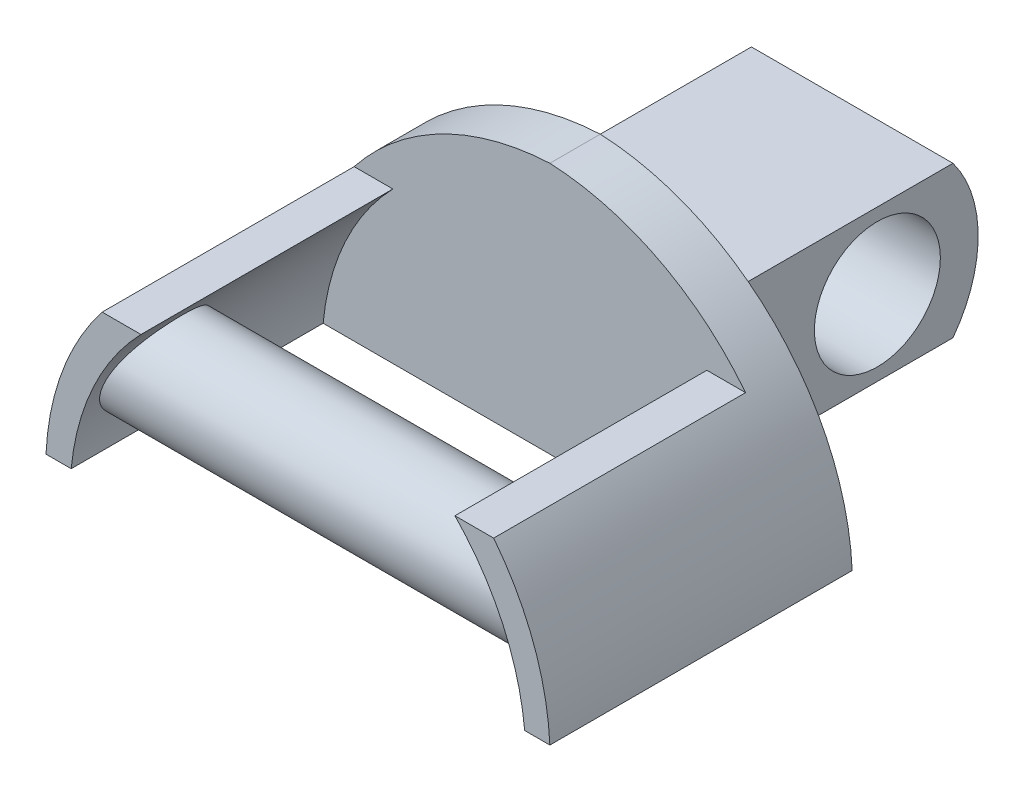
ISO-10303-21;
HEADER;
FILE_DESCRIPTION(('STEP AP214'),'2;1');
FILE_NAME('part.step','',(''),(''),'','','');
FILE_SCHEMA(('AUTOMOTIVE_DESIGN { 1 0 10303 214 1 1 1 1 }'));
ENDSEC;
DATA;
#1=APPLICATION_CONTEXT('core data for automotive mechanical design processes');
#2=APPLICATION_PROTOCOL_DEFINITION('international standard','automotive_design',2000,#1);
#3=PRODUCT_CONTEXT('',#1,'mechanical');
#4=PRODUCT('Part','Part','',(#3));
#5=PRODUCT_RELATED_PRODUCT_CATEGORY('part','',(#4));
#6=PRODUCT_DEFINITION_FORMATION('','',#4);
#7=PRODUCT_DEFINITION_CONTEXT('part definition',#1,'design');
#8=PRODUCT_DEFINITION('design','',#6,#7);
#9=PRODUCT_DEFINITION_SHAPE('','',#8);
#10=(LENGTH_UNIT() NAMED_UNIT(*) SI_UNIT(.MILLI.,.METRE.));
#11=(NAMED_UNIT(*) PLANE_ANGLE_UNIT() SI_UNIT($,.RADIAN.));
#12=(NAMED_UNIT(*) SI_UNIT($,.STERADIAN.) SOLID_ANGLE_UNIT());
#13=UNCERTAINTY_MEASURE_WITH_UNIT(LENGTH_MEASURE(1.E-05),#10,'distance_accuracy_value','');
#14=(GEOMETRIC_REPRESENTATION_CONTEXT(3) GLOBAL_UNCERTAINTY_ASSIGNED_CONTEXT((#13)) GLOBAL_UNIT_ASSIGNED_CONTEXT((#10,
#11,#12)) REPRESENTATION_CONTEXT('',''));
#15=CARTESIAN_POINT('',(0.,0.,0.));
#16=DIRECTION('',(0.,0.,1.));
#17=DIRECTION('',(1.,0.,0.));
#18=AXIS2_PLACEMENT_3D('',#15,#16,#17);
#19=CARTESIAN_POINT('',(0.482716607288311,-0.482716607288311,12.));
#20=DIRECTION('',(0.,0.,1.));
#21=DIRECTION('',(1.,0.,0.));
#22=AXIS2_PLACEMENT_3D('',#19,#20,#21);
#23=PLANE('',#22);
#24=DIRECTION('',(1.,0.,0.));
#25=VECTOR('',#24,1.);
#26=CARTESIAN_POINT('',(-8.,6.,12.));
#27=LINE('',#26,#25);
#28=CARTESIAN_POINT('',(-7.76923759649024,6.,12.));
#29=VERTEX_POINT('',#28);
#30=CARTESIAN_POINT('',(-6.23152814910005,6.,12.));
#31=VERTEX_POINT('',#30);
#32=EDGE_CURVE('E293',#29,#31,#27,.T.);
#33=ORIENTED_EDGE('',*,*,#32,.F.);
#34=CARTESIAN_POINT('',(0.482716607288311,-0.482716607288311,12.));
#35=DIRECTION('',(0.,0.,1.));
#36=DIRECTION('',(1.,0.,0.));
#37=AXIS2_PLACEMENT_3D('',#34,#35,#36);
#38=CIRCLE('',#37,10.4938249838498);
#39=CARTESIAN_POINT('',(-10.,0.,12.));
#40=VERTEX_POINT('',#39);
#41=EDGE_CURVE('E263',#29,#40,#38,.T.);
#42=ORIENTED_EDGE('',*,*,#41,.T.);
#43=DIRECTION('',(1.,0.,0.));
#44=VECTOR('',#43,1.);
#45=CARTESIAN_POINT('',(10.,0.,12.));
#46=LINE('',#45,#44);
#47=CARTESIAN_POINT('',(-9.,0.,12.));
#48=VERTEX_POINT('',#47);
#49=EDGE_CURVE('E177',#40,#48,#46,.T.);
#50=ORIENTED_EDGE('',*,*,#49,.T.);
#51=CARTESIAN_POINT('',(0.954356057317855,-0.954356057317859,12.));
#52=DIRECTION('',(0.,0.,1.));
#53=DIRECTION('',(1.,0.,0.));
#54=AXIS2_PLACEMENT_3D('',#51,#52,#53);
#55=CIRCLE('',#54,10.);
#56=EDGE_CURVE('E292',#31,#48,#55,.T.);
#57=ORIENTED_EDGE('',*,*,#56,.F.);
#58=EDGE_LOOP('',(#33,#42,#50,#57));
#59=FACE_BOUND('',#58,.T.);
#60=ADVANCED_FACE('F44',(#59),#23,.T.);
#61=CARTESIAN_POINT('',(-0.954356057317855,-0.954356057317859,2.));
#62=DIRECTION('',(0.,0.,1.));
#63=DIRECTION('',(1.,0.,0.));
#64=AXIS2_PLACEMENT_3D('',#61,#62,#63);
#65=CYLINDRICAL_SURFACE('',#64,10.);
#66=CARTESIAN_POINT('',(-0.954356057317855,-0.954356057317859,12.));
#67=DIRECTION('',(0.,0.,1.));
#68=DIRECTION('',(-1.,0.,0.));
#69=AXIS2_PLACEMENT_3D('',#66,#67,#68);
#70=CIRCLE('',#69,10.);
#71=CARTESIAN_POINT('',(9.,0.,12.));
#72=VERTEX_POINT('',#71);
#73=CARTESIAN_POINT('',(6.23152814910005,6.,12.));
#74=VERTEX_POINT('',#73);
#75=EDGE_CURVE('E350',#72,#74,#70,.T.);
#76=ORIENTED_EDGE('',*,*,#75,.T.);
#77=DIRECTION('',(0.,0.,1.));
#78=VECTOR('',#77,1.);
#79=CARTESIAN_POINT('',(6.23152814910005,6.,2.));
#80=LINE('',#79,#78);
#81=CARTESIAN_POINT('',(6.23152814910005,6.,2.));
#82=VERTEX_POINT('',#81);
#83=EDGE_CURVE('E60',#74,#82,#80,.F.);
#84=ORIENTED_EDGE('',*,*,#83,.T.);
#85=CARTESIAN_POINT('',(-0.954356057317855,-0.954356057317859,2.));
#86=DIRECTION('',(0.,0.,1.));
#87=DIRECTION('',(-1.,0.,0.));
#88=AXIS2_PLACEMENT_3D('',#85,#86,#87);
#89=CIRCLE('',#88,10.);
#90=CARTESIAN_POINT('',(9.,0.,2.));
#91=VERTEX_POINT('',#90);
#92=EDGE_CURVE('E155',#91,#82,#89,.T.);
#93=ORIENTED_EDGE('',*,*,#92,.F.);
#94=DIRECTION('',(0.,0.,1.));
#95=VECTOR('',#94,1.);
#96=CARTESIAN_POINT('',(9.,0.,2.));
#97=LINE('',#96,#95);
#98=EDGE_CURVE('E260',#91,#72,#97,.T.);
#99=ORIENTED_EDGE('',*,*,#98,.T.);
#100=EDGE_LOOP('',(#76,#84,#93,#99));
#101=FACE_BOUND('',#100,.T.);
#102=CARTESIAN_POINT('',(8.23058096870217,3.,11.5));
#103=CARTESIAN_POINT('',(8.17672790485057,3.12507858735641,11.4999969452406));
#104=CARTESIAN_POINT('',(8.12028081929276,3.2490897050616,11.4882441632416));
#105=CARTESIAN_POINT('',(8.00406708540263,3.49140314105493,11.4426171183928));
#106=CARTESIAN_POINT('',(7.94429714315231,3.60969956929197,11.4087205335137));
#107=CARTESIAN_POINT('',(7.82377305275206,3.83740828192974,11.3203381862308));
#108=CARTESIAN_POINT('',(7.76302136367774,3.94683956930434,11.2658979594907));
#109=CARTESIAN_POINT('',(7.64288957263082,4.1546345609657,11.1376011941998));
#110=CARTESIAN_POINT('',(7.58351022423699,4.25299229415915,11.0637342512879));
#111=CARTESIAN_POINT('',(7.46792747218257,4.43798068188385,10.8957712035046));
#112=CARTESIAN_POINT('',(7.41182482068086,4.52429980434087,10.8012595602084));
#113=CARTESIAN_POINT('',(7.30847942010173,4.67895528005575,10.5943942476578));
#114=CARTESIAN_POINT('',(7.26121795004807,4.74732975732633,10.4820792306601));
#115=CARTESIAN_POINT('',(7.19244726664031,4.84495887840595,10.2777496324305));
#116=CARTESIAN_POINT('',(7.16745593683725,4.87980248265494,10.1895602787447));
#117=CARTESIAN_POINT('',(7.12610447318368,4.93694339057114,10.0072901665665));
#118=CARTESIAN_POINT('',(7.10973566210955,4.95925330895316,9.91321543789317));
#119=CARTESIAN_POINT('',(7.08700900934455,4.99012303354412,9.72115564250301));
#120=CARTESIAN_POINT('',(7.08069860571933,4.99861768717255,9.62315426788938));
#121=CARTESIAN_POINT('',(7.07888178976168,5.00106957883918,9.42686347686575));
#122=CARTESIAN_POINT('',(7.08337467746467,4.9950277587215,9.32857407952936));
#123=CARTESIAN_POINT('',(7.1019768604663,4.96980716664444,9.14214941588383));
#124=CARTESIAN_POINT('',(7.11535228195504,4.95163041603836,9.05379998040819));
#125=CARTESIAN_POINT('',(7.14989282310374,4.90414249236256,8.8817681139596));
#126=CARTESIAN_POINT('',(7.17105979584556,4.8748286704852,8.79808679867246));
#127=CARTESIAN_POINT('',(7.22142822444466,4.80399048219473,8.63145937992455));
#128=CARTESIAN_POINT('',(7.25107597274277,4.76177481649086,8.54894512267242));
#129=CARTESIAN_POINT('',(7.31588481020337,4.66759944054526,8.39207643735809));
#130=CARTESIAN_POINT('',(7.35104860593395,4.61563494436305,8.31772604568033));
#131=CARTESIAN_POINT('',(7.43167109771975,4.49364881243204,8.16580977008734));
#132=CARTESIAN_POINT('',(7.47786014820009,4.42205865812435,8.08989142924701));
#133=CARTESIAN_POINT('',(7.57339935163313,4.26919917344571,7.95086351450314));
#134=CARTESIAN_POINT('',(7.62275167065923,4.18792317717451,7.88776284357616));
#135=CARTESIAN_POINT('',(7.73088670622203,4.00343909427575,7.76586558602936));
#136=CARTESIAN_POINT('',(7.78990396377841,3.89880966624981,7.70941464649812));
#137=CARTESIAN_POINT('',(7.90733899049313,3.68091044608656,7.61574054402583));
#138=CARTESIAN_POINT('',(7.96575647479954,3.56763674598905,7.57852613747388));
#139=CARTESIAN_POINT('',(8.08304737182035,3.32863079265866,7.52317355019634));
#140=CARTESIAN_POINT('',(8.14177320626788,3.20255602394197,7.50618129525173));
#141=CARTESIAN_POINT('',(8.25417311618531,2.94723541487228,7.49662437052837));
#142=CARTESIAN_POINT('',(8.30784903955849,2.81799075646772,7.50405072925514));
#143=CARTESIAN_POINT('',(8.40551905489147,2.56837711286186,7.54329017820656));
#144=CARTESIAN_POINT('',(8.44989613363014,2.44793174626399,7.57364905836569));
#145=CARTESIAN_POINT('',(8.5316850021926,2.21274126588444,7.657239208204));
#146=CARTESIAN_POINT('',(8.56910116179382,2.09799260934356,7.71045605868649));
#147=CARTESIAN_POINT('',(8.63348064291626,1.88893286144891,7.83300534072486));
#148=CARTESIAN_POINT('',(8.66108190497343,1.79371186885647,7.90045454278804));
#149=CARTESIAN_POINT('',(8.71020681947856,1.61561773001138,8.05185339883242));
#150=CARTESIAN_POINT('',(8.73173247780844,1.53274051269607,8.13579759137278));
#151=CARTESIAN_POINT('',(8.76801581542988,1.38676447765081,8.31261610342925));
#152=CARTESIAN_POINT('',(8.7830842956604,1.32281966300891,8.40473003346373));
#153=CARTESIAN_POINT('',(8.80855539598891,1.21102148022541,8.59883745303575));
#154=CARTESIAN_POINT('',(8.8189585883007,1.16316613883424,8.70082972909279));
#155=CARTESIAN_POINT('',(8.83537739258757,1.08590353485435,8.90973662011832));
#156=CARTESIAN_POINT('',(8.84147078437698,1.05617065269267,9.01652489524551));
#157=CARTESIAN_POINT('',(8.84988545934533,1.01473032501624,9.23368788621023));
#158=CARTESIAN_POINT('',(8.85220682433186,1.00302248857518,9.34406252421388));
#159=CARTESIAN_POINT('',(8.85320537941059,0.998013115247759,9.56492178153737));
#160=CARTESIAN_POINT('',(8.85189315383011,1.00465811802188,9.675405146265));
#161=CARTESIAN_POINT('',(8.84557350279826,1.03602896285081,9.89366533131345));
#162=CARTESIAN_POINT('',(8.84056612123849,1.06075459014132,10.0014421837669));
#163=CARTESIAN_POINT('',(8.8265973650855,1.12749490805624,10.2112235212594));
#164=CARTESIAN_POINT('',(8.81763627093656,1.16950837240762,10.3132284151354));
#165=CARTESIAN_POINT('',(8.79537562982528,1.26945607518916,10.5085909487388));
#166=CARTESIAN_POINT('',(8.78207626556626,1.32738964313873,10.6019489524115));
#167=CARTESIAN_POINT('',(8.75069829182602,1.45736134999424,10.7775833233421));
#168=CARTESIAN_POINT('',(8.73261226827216,1.52942132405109,10.859842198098));
#169=CARTESIAN_POINT('',(8.69133459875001,1.68517571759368,11.0109643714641));
#170=CARTESIAN_POINT('',(8.66814266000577,1.76887080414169,11.0798269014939));
#171=CARTESIAN_POINT('',(8.61618472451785,1.94622680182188,11.2033457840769));
#172=CARTESIAN_POINT('',(8.58735285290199,2.03999892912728,11.2578143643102));
#173=CARTESIAN_POINT('',(8.52442840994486,2.23358882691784,11.3504401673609));
#174=CARTESIAN_POINT('',(8.49033668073,2.33340562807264,11.3885999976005));
#175=CARTESIAN_POINT('',(8.42034196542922,2.5277131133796,11.4458523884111));
#176=CARTESIAN_POINT('',(8.38482371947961,2.62195890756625,11.4662638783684));
#177=CARTESIAN_POINT('',(8.31022173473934,2.81100483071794,11.4933408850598));
#178=CARTESIAN_POINT('',(8.27113693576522,2.90580511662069,11.5000023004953));
#179=CARTESIAN_POINT('',(8.23058096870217,3.,11.5));
#180=B_SPLINE_CURVE_WITH_KNOTS('',3,(#102,#103,#104,#105,#106,#107,#108,#109,#110,#111,#112,
#113,#114,#115,#116,#117,#118,#119,#120,#121,#122,#123,#124,#125,#126,#127,#128,#129,#130,#131,
#132,#133,#134,#135,#136,#137,#138,#139,#140,#141,#142,#143,#144,#145,#146,#147,#148,#149,#150,
#151,#152,#153,#154,#155,#156,#157,#158,#159,#160,#161,#162,#163,#164,#165,#166,#167,#168,#169,
#170,#171,#172,#173,#174,#175,#176,#177,#178,#179),.UNSPECIFIED.,.T.,.F.,(4,2,2,2,2,2,2,2,2,2,2,
2,2,2,2,2,2,2,2,2,2,2,2,2,2,2,2,2,2,2,2,2,2,2,2,2,2,2,4),(0.,0.408145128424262,
0.816702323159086,1.22435920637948,1.6322348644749,2.04923413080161,2.4653401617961,
2.75833680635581,3.05103802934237,3.34511566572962,3.63917424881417,3.91153952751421,
4.18396962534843,4.47481017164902,4.76579387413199,5.10684011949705,5.44812244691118,
5.84458723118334,6.24123232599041,6.65942143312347,7.07745691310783,7.47100137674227,
7.86429794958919,8.22217073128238,8.57992522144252,8.91770300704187,9.25543935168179,
9.5869132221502,9.91837990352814,10.2488820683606,10.5793803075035,10.9098551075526,
11.2403159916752,11.5712917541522,11.902286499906,12.2374069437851,12.5724737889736,
12.87975036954,13.1871185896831),.UNSPECIFIED.);
#181=CARTESIAN_POINT('',(8.23058096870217,3.,11.5));
#182=VERTEX_POINT('',#181);
#183=EDGE_CURVE('E53',#182,#182,#180,.T.);
#184=ORIENTED_EDGE('',*,*,#183,.F.);
#185=EDGE_LOOP('',(#184));
#186=FACE_BOUND('',#185,.T.);
#187=ADVANCED_FACE('F235',(#101,#186),#65,.F.);
#188=CARTESIAN_POINT('',(0.954356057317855,-0.954356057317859,2.));
#189=DIRECTION('',(0.,0.,1.));
#190=DIRECTION('',(1.,0.,0.));
#191=AXIS2_PLACEMENT_3D('',#188,#189,#190);
#192=CYLINDRICAL_SURFACE('',#191,10.);
#193=CARTESIAN_POINT('',(0.954356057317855,-0.954356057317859,2.));
#194=DIRECTION('',(0.,0.,1.));
#195=DIRECTION('',(1.,0.,0.));
#196=AXIS2_PLACEMENT_3D('',#193,#194,#195);
#197=CIRCLE('',#196,10.);
#198=CARTESIAN_POINT('',(-6.23152814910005,6.,2.));
#199=VERTEX_POINT('',#198);
#200=CARTESIAN_POINT('',(-9.,0.,2.));
#201=VERTEX_POINT('',#200);
#202=EDGE_CURVE('E358',#199,#201,#197,.T.);
#203=ORIENTED_EDGE('',*,*,#202,.F.);
#204=DIRECTION('',(0.,0.,1.));
#205=VECTOR('',#204,1.);
#206=CARTESIAN_POINT('',(-6.23152814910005,6.,2.));
#207=LINE('',#206,#205);
#208=EDGE_CURVE('E304',#199,#31,#207,.T.);
#209=ORIENTED_EDGE('',*,*,#208,.T.);
#210=ORIENTED_EDGE('',*,*,#56,.T.);
#211=DIRECTION('',(0.,0.,1.));
#212=VECTOR('',#211,1.);
#213=CARTESIAN_POINT('',(-9.,0.,2.));
#214=LINE('',#213,#212);
#215=EDGE_CURVE('E290',#201,#48,#214,.T.);
#216=ORIENTED_EDGE('',*,*,#215,.F.);
#217=EDGE_LOOP('',(#203,#209,#210,#216));
#218=FACE_BOUND('',#217,.T.);
#219=CARTESIAN_POINT('',(-8.23058096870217,3.,11.5));
#220=CARTESIAN_POINT('',(-8.2788257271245,2.88794750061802,11.5000020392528));
#221=CARTESIAN_POINT('',(-8.32499049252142,2.77502252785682,11.490572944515));
#222=CARTESIAN_POINT('',(-8.4120955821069,2.55050408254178,11.4521527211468));
#223=CARTESIAN_POINT('',(-8.45303948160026,2.43890974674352,11.4231750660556));
#224=CARTESIAN_POINT('',(-8.52907360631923,2.22023345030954,11.345392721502));
#225=CARTESIAN_POINT('',(-8.56414364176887,2.11316796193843,11.2965215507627));
#226=CARTESIAN_POINT('',(-8.62787172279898,1.90789308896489,11.1796546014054));
#227=CARTESIAN_POINT('',(-8.65653041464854,1.80968281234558,11.1116607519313));
#228=CARTESIAN_POINT('',(-8.70603450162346,1.63117577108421,10.9625609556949));
#229=CARTESIAN_POINT('',(-8.72722720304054,1.55018438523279,10.8824008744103));
#230=CARTESIAN_POINT('',(-8.76422830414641,1.4025329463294,10.7087510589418));
#231=CARTESIAN_POINT('',(-8.7800378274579,1.3358699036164,10.6152641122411));
#232=CARTESIAN_POINT('',(-8.80625907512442,1.22135872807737,10.4212380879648));
#233=CARTESIAN_POINT('',(-8.81684158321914,1.17292968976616,10.3210642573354));
#234=CARTESIAN_POINT('',(-8.8338457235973,1.09327068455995,10.1137668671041));
#235=CARTESIAN_POINT('',(-8.84026762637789,1.06203959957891,10.0066437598));
#236=CARTESIAN_POINT('',(-8.84923222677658,1.01799340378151,9.78950928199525));
#237=CARTESIAN_POINT('',(-8.85180861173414,1.00501842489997,9.67953168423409));
#238=CARTESIAN_POINT('',(-8.85333222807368,0.997378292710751,9.45891685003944));
#239=CARTESIAN_POINT('',(-8.8522794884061,1.00271299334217,9.34827961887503));
#240=CARTESIAN_POINT('',(-8.84648771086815,1.03151224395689,9.12958003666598));
#241=CARTESIAN_POINT('',(-8.84175162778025,1.05496226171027,9.02151569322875));
#242=CARTESIAN_POINT('',(-8.82834947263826,1.1192257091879,8.81093888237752));
#243=CARTESIAN_POINT('',(-8.81968348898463,1.1600387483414,8.70842629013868));
#244=CARTESIAN_POINT('',(-8.79803992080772,1.25771602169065,8.51182116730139));
#245=CARTESIAN_POINT('',(-8.78506125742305,1.3145842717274,8.41773075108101));
#246=CARTESIAN_POINT('',(-8.75437589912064,1.44248221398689,8.24060697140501));
#247=CARTESIAN_POINT('',(-8.73666935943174,1.51351144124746,8.1575732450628));
#248=CARTESIAN_POINT('',(-8.69608667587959,1.66772828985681,8.00436565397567));
#249=CARTESIAN_POINT('',(-8.67318623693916,1.75097238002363,7.934255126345));
#250=CARTESIAN_POINT('',(-8.62210031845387,1.92658752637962,7.80901768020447));
#251=CARTESIAN_POINT('',(-8.59391454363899,2.01895909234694,7.7538915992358));
#252=CARTESIAN_POINT('',(-8.53163948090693,2.21209404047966,7.65851407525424));
#253=CARTESIAN_POINT('',(-8.49742895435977,2.31300190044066,7.61863530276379));
#254=CARTESIAN_POINT('',(-8.42397937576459,2.51820913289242,7.55593238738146));
#255=CARTESIAN_POINT('',(-8.38473914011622,2.62250929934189,7.53311226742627));
#256=CARTESIAN_POINT('',(-8.29955142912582,2.83765170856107,7.50347883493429));
#257=CARTESIAN_POINT('',(-8.25334911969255,2.94852794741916,7.49765216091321));
#258=CARTESIAN_POINT('',(-8.15716969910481,3.16808099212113,7.50404790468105));
#259=CARTESIAN_POINT('',(-8.10719135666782,3.27675706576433,7.51627623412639));
#260=CARTESIAN_POINT('',(-8.00035832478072,3.4986779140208,7.55959499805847));
#261=CARTESIAN_POINT('',(-7.94328111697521,3.61151840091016,7.59220930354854));
#262=CARTESIAN_POINT('',(-7.82805440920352,3.82941736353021,7.67634270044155));
#263=CARTESIAN_POINT('',(-7.76990408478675,3.93446951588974,7.72787695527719));
#264=CARTESIAN_POINT('',(-7.65082378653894,4.1413348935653,7.85289794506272));
#265=CARTESIAN_POINT('',(-7.58997461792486,4.24243892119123,7.92764186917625));
#266=CARTESIAN_POINT('',(-7.4728671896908,4.43026462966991,8.09634472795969));
#267=CARTESIAN_POINT('',(-7.41660481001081,4.51699929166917,8.19028614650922));
#268=CARTESIAN_POINT('',(-7.3240971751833,4.65568787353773,8.37355954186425));
#269=CARTESIAN_POINT('',(-7.28616302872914,4.71110132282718,8.45942364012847));
#270=CARTESIAN_POINT('',(-7.21794078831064,4.80907422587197,8.64100689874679));
#271=CARTESIAN_POINT('',(-7.1876471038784,4.85164308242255,8.73671878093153));
#272=CARTESIAN_POINT('',(-7.13697926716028,4.92205560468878,8.93693330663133));
#273=CARTESIAN_POINT('',(-7.11668945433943,4.94977423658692,9.04150226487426));
#274=CARTESIAN_POINT('',(-7.08863483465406,4.9879405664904,9.25536033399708));
#275=CARTESIAN_POINT('',(-7.08085678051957,4.99840653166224,9.36464432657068));
#276=CARTESIAN_POINT('',(-7.07888777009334,5.00105952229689,9.56831445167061));
#277=CARTESIAN_POINT('',(-7.08296136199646,4.99558123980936,9.66266379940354));
#278=CARTESIAN_POINT('',(-7.10066603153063,4.97159015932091,9.84875685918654));
#279=CARTESIAN_POINT('',(-7.11429762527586,4.95307665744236,9.94050043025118));
#280=CARTESIAN_POINT('',(-7.14955604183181,4.90460902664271,10.1169799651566));
#281=CARTESIAN_POINT('',(-7.17099989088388,4.87491623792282,10.2018258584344));
#282=CARTESIAN_POINT('',(-7.2204439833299,4.805371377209,10.3651722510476));
#283=CARTESIAN_POINT('',(-7.24844637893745,4.76551596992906,10.4436706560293));
#284=CARTESIAN_POINT('',(-7.31356064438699,4.67105549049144,10.6033053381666));
#285=CARTESIAN_POINT('',(-7.35138889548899,4.61519332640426,10.6834021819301));
#286=CARTESIAN_POINT('',(-7.43151153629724,4.49381077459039,10.8333603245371));
#287=CARTESIAN_POINT('',(-7.47380835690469,4.42828512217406,10.9032160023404));
#288=CARTESIAN_POINT('',(-7.56908245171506,4.27636096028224,11.043847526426));
#289=CARTESIAN_POINT('',(-7.6226064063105,4.18833163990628,11.1124971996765));
#290=CARTESIAN_POINT('',(-7.73119191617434,4.00274502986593,11.2340208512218));
#291=CARTESIAN_POINT('',(-7.78625515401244,3.90517699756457,11.2868767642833));
#292=CARTESIAN_POINT('',(-7.9087507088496,3.67872962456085,11.3862555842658));
#293=CARTESIAN_POINT('',(-7.97607499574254,3.54785236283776,11.428431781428));
#294=CARTESIAN_POINT('',(-8.10687233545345,3.27843354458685,11.4852942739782));
#295=CARTESIAN_POINT('',(-8.17034773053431,3.13989674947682,11.4999974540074));
#296=CARTESIAN_POINT('',(-8.23058096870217,3.,11.5));
#297=B_SPLINE_CURVE_WITH_KNOTS('',3,(#219,#220,#221,#222,#223,#224,#225,#226,#227,#228,#229,
#230,#231,#232,#233,#234,#235,#236,#237,#238,#239,#240,#241,#242,#243,#244,#245,#246,#247,#248,
#249,#250,#251,#252,#253,#254,#255,#256,#257,#258,#259,#260,#261,#262,#263,#264,#265,#266,#267,
#268,#269,#270,#271,#272,#273,#274,#275,#276,#277,#278,#279,#280,#281,#282,#283,#284,#285,#286,
#287,#288,#289,#290,#291,#292,#293,#294,#295,#296),.UNSPECIFIED.,.T.,.F.,(4,2,2,2,2,2,2,2,2,2,2,
2,2,2,2,2,2,2,2,2,2,2,2,2,2,2,2,2,2,2,2,2,2,2,2,2,2,2,4),(0.,0.365530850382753,
0.730810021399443,1.09732005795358,1.4637931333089,1.80977273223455,2.15568007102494,
2.48938160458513,2.8230614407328,3.15380067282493,3.48453726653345,3.81500881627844,
4.14547293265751,4.4760197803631,4.80655577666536,5.13867100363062,5.47080479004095,
5.81060420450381,6.15048372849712,6.5097383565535,6.86911063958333,7.25922110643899,
7.64964491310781,8.06668851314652,8.48335328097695,8.80909044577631,9.13458857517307,
9.46278585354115,9.79063541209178,10.0729963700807,10.3553725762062,10.6315207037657,
10.9077595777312,11.2207641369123,11.5339398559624,11.9038540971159,12.2741898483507,
12.730833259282,13.1871959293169),.UNSPECIFIED.);
#298=CARTESIAN_POINT('',(-8.23058096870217,3.,11.5));
#299=VERTEX_POINT('',#298);
#300=EDGE_CURVE('E185',#299,#299,#297,.T.);
#301=ORIENTED_EDGE('',*,*,#300,.F.);
#302=EDGE_LOOP('',(#301));
#303=FACE_BOUND('',#302,.T.);
#304=ADVANCED_FACE('F197',(#218,#303),#192,.F.);
#305=CARTESIAN_POINT('',(0.482716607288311,-0.482716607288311,0.));
#306=DIRECTION('',(0.,0.,1.));
#307=DIRECTION('',(1.,0.,0.));
#308=AXIS2_PLACEMENT_3D('',#305,#306,#307);
#309=PLANE('',#308);
#310=DIRECTION('',(0.,-1.,0.));
#311=VECTOR('',#310,1.);
#312=CARTESIAN_POINT('',(4.,6.,0.));
#313=LINE('',#312,#311);
#314=CARTESIAN_POINT('',(4.,6.,0.));
#315=VERTEX_POINT('',#314);
#316=CARTESIAN_POINT('',(4.,0.,0.));
#317=VERTEX_POINT('',#316);
#318=EDGE_CURVE('E316',#315,#317,#313,.T.);
#319=ORIENTED_EDGE('',*,*,#318,.F.);
#320=DIRECTION('',(1.,0.,0.));
#321=VECTOR('',#320,1.);
#322=CARTESIAN_POINT('',(-4.,6.,0.));
#323=LINE('',#322,#321);
#324=CARTESIAN_POINT('',(-4.,6.,0.));
#325=VERTEX_POINT('',#324);
#326=EDGE_CURVE('E347',#325,#315,#323,.T.);
#327=ORIENTED_EDGE('',*,*,#326,.F.);
#328=DIRECTION('',(0.,-1.,0.));
#329=VECTOR('',#328,1.);
#330=CARTESIAN_POINT('',(-4.,6.,0.));
#331=LINE('',#330,#329);
#332=CARTESIAN_POINT('',(-4.,0.,0.));
#333=VERTEX_POINT('',#332);
#334=EDGE_CURVE('E333',#325,#333,#331,.T.);
#335=ORIENTED_EDGE('',*,*,#334,.T.);
#336=DIRECTION('',(1.,0.,0.));
#337=VECTOR('',#336,1.);
#338=CARTESIAN_POINT('',(10.,0.,0.));
#339=LINE('',#338,#337);
#340=CARTESIAN_POINT('',(-10.,0.,0.));
#341=VERTEX_POINT('',#340);
#342=EDGE_CURVE('E274',#341,#333,#339,.T.);
#343=ORIENTED_EDGE('',*,*,#342,.F.);
#344=CARTESIAN_POINT('',(0.482716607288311,-0.482716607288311,0.));
#345=DIRECTION('',(0.,0.,1.));
#346=DIRECTION('',(1.,0.,0.));
#347=AXIS2_PLACEMENT_3D('',#344,#345,#346);
#348=CIRCLE('',#347,10.4938249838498);
#349=CARTESIAN_POINT('',(0.,10.,0.));
#350=VERTEX_POINT('',#349);
#351=EDGE_CURVE('E271',#350,#341,#348,.T.);
#352=ORIENTED_EDGE('',*,*,#351,.F.);
#353=CARTESIAN_POINT('',(-0.482716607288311,-0.482716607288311,0.));
#354=DIRECTION('',(0.,0.,1.));
#355=DIRECTION('',(-1.,0.,0.));
#356=AXIS2_PLACEMENT_3D('',#353,#354,#355);
#357=CIRCLE('',#356,10.4938249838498);
#358=CARTESIAN_POINT('',(10.,0.,0.));
#359=VERTEX_POINT('',#358);
#360=EDGE_CURVE('E165',#359,#350,#357,.T.);
#361=ORIENTED_EDGE('',*,*,#360,.F.);
#362=EDGE_CURVE('E273',#317,#359,#339,.T.);
#363=ORIENTED_EDGE('',*,*,#362,.F.);
#364=EDGE_LOOP('',(#319,#327,#335,#343,#352,#361,#363));
#365=FACE_BOUND('',#364,.T.);
#366=ADVANCED_FACE('F244',(#365),#309,.F.);
#367=CARTESIAN_POINT('',(0.482716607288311,-0.482716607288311,12.));
#368=DIRECTION('',(0.,0.,-1.));
#369=DIRECTION('',(-1.,0.,0.));
#370=AXIS2_PLACEMENT_3D('',#367,#368,#369);
#371=CYLINDRICAL_SURFACE('',#370,10.4938249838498);
#372=DIRECTION('',(0.,0.,-1.));
#373=VECTOR('',#372,1.);
#374=CARTESIAN_POINT('',(-7.76923759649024,6.,12.));
#375=LINE('',#374,#373);
#376=CARTESIAN_POINT('',(-7.76923759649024,6.,2.));
#377=VERTEX_POINT('',#376);
#378=EDGE_CURVE('E148',#29,#377,#375,.T.);
#379=ORIENTED_EDGE('',*,*,#378,.T.);
#380=CARTESIAN_POINT('',(0.482716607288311,-0.482716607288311,2.));
#381=DIRECTION('',(0.,0.,-1.));
#382=DIRECTION('',(-1.,0.,0.));
#383=AXIS2_PLACEMENT_3D('',#380,#381,#382);
#384=CIRCLE('',#383,10.4938249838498);
#385=CARTESIAN_POINT('',(0.,10.,2.));
#386=VERTEX_POINT('',#385);
#387=EDGE_CURVE('E309',#377,#386,#384,.T.);
#388=ORIENTED_EDGE('',*,*,#387,.T.);
#389=DIRECTION('',(0.,0.,-1.));
#390=VECTOR('',#389,1.);
#391=CARTESIAN_POINT('',(0.,10.,12.));
#392=LINE('',#391,#390);
#393=EDGE_CURVE('E162',#386,#350,#392,.T.);
#394=ORIENTED_EDGE('',*,*,#393,.T.);
#395=ORIENTED_EDGE('',*,*,#351,.T.);
#396=DIRECTION('',(0.,0.,-1.));
#397=VECTOR('',#396,1.);
#398=CARTESIAN_POINT('',(-10.,0.,12.));
#399=LINE('',#398,#397);
#400=EDGE_CURVE('E175',#40,#341,#399,.T.);
#401=ORIENTED_EDGE('',*,*,#400,.F.);
#402=ORIENTED_EDGE('',*,*,#41,.F.);
#403=EDGE_LOOP('',(#379,#388,#394,#395,#401,#402));
#404=FACE_BOUND('',#403,.T.);
#405=ADVANCED_FACE('F46',(#404),#371,.T.);
#406=CARTESIAN_POINT('',(10.,0.,12.));
#407=DIRECTION('',(0.,1.,0.));
#408=DIRECTION('',(0.,0.,1.));
#409=AXIS2_PLACEMENT_3D('',#406,#407,#408);
#410=PLANE('',#409);
#411=CARTESIAN_POINT('',(10.,0.,12.));
#412=VERTEX_POINT('',#411);
#413=EDGE_CURVE('E258',#72,#412,#46,.T.);
#414=ORIENTED_EDGE('',*,*,#413,.F.);
#415=ORIENTED_EDGE('',*,*,#98,.F.);
#416=DIRECTION('',(1.,0.,0.));
#417=VECTOR('',#416,1.);
#418=CARTESIAN_POINT('',(-9.,0.,2.));
#419=LINE('',#418,#417);
#420=EDGE_CURVE('E361',#201,#91,#419,.T.);
#421=ORIENTED_EDGE('',*,*,#420,.F.);
#422=ORIENTED_EDGE('',*,*,#215,.T.);
#423=ORIENTED_EDGE('',*,*,#49,.F.);
#424=ORIENTED_EDGE('',*,*,#400,.T.);
#425=ORIENTED_EDGE('',*,*,#342,.T.);
#426=DIRECTION('',(0.,0.,-1.));
#427=VECTOR('',#426,1.);
#428=CARTESIAN_POINT('',(-4.,0.,0.));
#429=LINE('',#428,#427);
#430=CARTESIAN_POINT('',(-4.,0.,-10.));
#431=VERTEX_POINT('',#430);
#432=EDGE_CURVE('E68',#333,#431,#429,.T.);
#433=ORIENTED_EDGE('',*,*,#432,.T.);
#434=DIRECTION('',(1.,0.,0.));
#435=VECTOR('',#434,1.);
#436=CARTESIAN_POINT('',(-4.,0.,-10.));
#437=LINE('',#436,#435);
#438=CARTESIAN_POINT('',(4.,0.,-10.));
#439=VERTEX_POINT('',#438);
#440=EDGE_CURVE('E346',#431,#439,#437,.T.);
#441=ORIENTED_EDGE('',*,*,#440,.T.);
#442=DIRECTION('',(0.,0.,-1.));
#443=VECTOR('',#442,1.);
#444=CARTESIAN_POINT('',(4.,0.,0.));
#445=LINE('',#444,#443);
#446=EDGE_CURVE('E281',#317,#439,#445,.T.);
#447=ORIENTED_EDGE('',*,*,#446,.F.);
#448=ORIENTED_EDGE('',*,*,#362,.T.);
#449=DIRECTION('',(0.,0.,-1.));
#450=VECTOR('',#449,1.);
#451=CARTESIAN_POINT('',(10.,0.,12.));
#452=LINE('',#451,#450);
#453=EDGE_CURVE('E170',#412,#359,#452,.T.);
#454=ORIENTED_EDGE('',*,*,#453,.F.);
#455=EDGE_LOOP('',(#414,#415,#421,#422,#423,#424,#425,#433,#441,#447,#448,#454));
#456=FACE_BOUND('',#455,.T.);
#457=ADVANCED_FACE('F249',(#456),#410,.F.);
#458=CARTESIAN_POINT('',(-0.482716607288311,-0.482716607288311,12.));
#459=DIRECTION('',(0.,0.,-1.));
#460=DIRECTION('',(-1.,0.,0.));
#461=AXIS2_PLACEMENT_3D('',#458,#459,#460);
#462=CYLINDRICAL_SURFACE('',#461,10.4938249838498);
#463=ORIENTED_EDGE('',*,*,#393,.F.);
#464=CARTESIAN_POINT('',(-0.482716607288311,-0.482716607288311,2.));
#465=DIRECTION('',(0.,0.,-1.));
#466=DIRECTION('',(-1.,0.,0.));
#467=AXIS2_PLACEMENT_3D('',#464,#465,#466);
#468=CIRCLE('',#467,10.4938249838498);
#469=CARTESIAN_POINT('',(7.76923759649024,6.,2.));
#470=VERTEX_POINT('',#469);
#471=EDGE_CURVE('E11',#386,#470,#468,.T.);
#472=ORIENTED_EDGE('',*,*,#471,.T.);
#473=DIRECTION('',(0.,0.,-1.));
#474=VECTOR('',#473,1.);
#475=CARTESIAN_POINT('',(7.76923759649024,6.,12.));
#476=LINE('',#475,#474);
#477=CARTESIAN_POINT('',(7.76923759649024,6.,12.));
#478=VERTEX_POINT('',#477);
#479=EDGE_CURVE('E139',#470,#478,#476,.F.);
#480=ORIENTED_EDGE('',*,*,#479,.T.);
#481=CARTESIAN_POINT('',(-0.482716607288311,-0.482716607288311,12.));
#482=DIRECTION('',(0.,0.,1.));
#483=DIRECTION('',(-1.,0.,0.));
#484=AXIS2_PLACEMENT_3D('',#481,#482,#483);
#485=CIRCLE('',#484,10.4938249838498);
#486=EDGE_CURVE('E171',#412,#478,#485,.T.);
#487=ORIENTED_EDGE('',*,*,#486,.F.);
#488=ORIENTED_EDGE('',*,*,#453,.T.);
#489=ORIENTED_EDGE('',*,*,#360,.T.);
#490=EDGE_LOOP('',(#463,#472,#480,#487,#488,#489));
#491=FACE_BOUND('',#490,.T.);
#492=ADVANCED_FACE('F160',(#491),#462,.T.);
#493=EDGE_CURVE('E143',#74,#478,#27,.T.);
#494=ORIENTED_EDGE('',*,*,#493,.F.);
#495=ORIENTED_EDGE('',*,*,#75,.F.);
#496=ORIENTED_EDGE('',*,*,#413,.T.);
#497=ORIENTED_EDGE('',*,*,#486,.T.);
#498=EDGE_LOOP('',(#494,#495,#496,#497));
#499=FACE_BOUND('',#498,.T.);
#500=ADVANCED_FACE('F227',(#499),#23,.T.);
#501=CARTESIAN_POINT('',(-0.954356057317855,-0.954356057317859,2.));
#502=DIRECTION('',(0.,0.,-1.));
#503=DIRECTION('',(-1.,0.,0.));
#504=AXIS2_PLACEMENT_3D('',#501,#502,#503);
#505=PLANE('',#504);
#506=ORIENTED_EDGE('',*,*,#92,.T.);
#507=DIRECTION('',(-1.,0.,0.));
#508=VECTOR('',#507,1.);
#509=CARTESIAN_POINT('',(-8.,6.,2.));
#510=LINE('',#509,#508);
#511=EDGE_CURVE('E142',#470,#82,#510,.T.);
#512=ORIENTED_EDGE('',*,*,#511,.F.);
#513=ORIENTED_EDGE('',*,*,#471,.F.);
#514=ORIENTED_EDGE('',*,*,#387,.F.);
#515=EDGE_CURVE('E157',#199,#377,#510,.T.);
#516=ORIENTED_EDGE('',*,*,#515,.F.);
#517=ORIENTED_EDGE('',*,*,#202,.T.);
#518=ORIENTED_EDGE('',*,*,#420,.T.);
#519=EDGE_LOOP('',(#506,#512,#513,#514,#516,#517,#518));
#520=FACE_BOUND('',#519,.T.);
#521=ADVANCED_FACE('F152',(#520),#505,.F.);
#522=CARTESIAN_POINT('',(-4.,6.,0.));
#523=DIRECTION('',(0.,1.,0.));
#524=DIRECTION('',(0.,0.,1.));
#525=AXIS2_PLACEMENT_3D('',#522,#523,#524);
#526=PLANE('',#525);
#527=ORIENTED_EDGE('',*,*,#326,.T.);
#528=DIRECTION('',(0.,0.,1.));
#529=VECTOR('',#528,1.);
#530=CARTESIAN_POINT('',(4.,6.,0.));
#531=LINE('',#530,#529);
#532=CARTESIAN_POINT('',(4.,6.,-10.));
#533=VERTEX_POINT('',#532);
#534=EDGE_CURVE('E325',#533,#315,#531,.T.);
#535=ORIENTED_EDGE('',*,*,#534,.F.);
#536=DIRECTION('',(1.,0.,0.));
#537=VECTOR('',#536,1.);
#538=CARTESIAN_POINT('',(-4.,6.,-10.));
#539=LINE('',#538,#537);
#540=CARTESIAN_POINT('',(-4.,6.,-10.));
#541=VERTEX_POINT('',#540);
#542=EDGE_CURVE('E351',#541,#533,#539,.T.);
#543=ORIENTED_EDGE('',*,*,#542,.F.);
#544=DIRECTION('',(0.,0.,1.));
#545=VECTOR('',#544,1.);
#546=CARTESIAN_POINT('',(-4.,6.,0.));
#547=LINE('',#546,#545);
#548=EDGE_CURVE('E342',#541,#325,#547,.T.);
#549=ORIENTED_EDGE('',*,*,#548,.T.);
#550=EDGE_LOOP('',(#527,#535,#543,#549));
#551=FACE_BOUND('',#550,.T.);
#552=ADVANCED_FACE('F220',(#551),#526,.T.);
#553=CARTESIAN_POINT('',(-4.,3.,-6.));
#554=DIRECTION('',(1.,0.,0.));
#555=DIRECTION('',(0.,0.,-1.));
#556=AXIS2_PLACEMENT_3D('',#553,#554,#555);
#557=CYLINDRICAL_SURFACE('',#556,5.);
#558=ORIENTED_EDGE('',*,*,#542,.T.);
#559=CARTESIAN_POINT('',(4.,3.,-6.));
#560=DIRECTION('',(1.,0.,0.));
#561=DIRECTION('',(0.,0.,1.));
#562=AXIS2_PLACEMENT_3D('',#559,#560,#561);
#563=CIRCLE('',#562,5.);
#564=EDGE_CURVE('E321',#439,#533,#563,.T.);
#565=ORIENTED_EDGE('',*,*,#564,.F.);
#566=ORIENTED_EDGE('',*,*,#440,.F.);
#567=CARTESIAN_POINT('',(-4.,3.,-6.));
#568=DIRECTION('',(1.,0.,0.));
#569=DIRECTION('',(0.,0.,1.));
#570=AXIS2_PLACEMENT_3D('',#567,#568,#569);
#571=CIRCLE('',#570,5.);
#572=EDGE_CURVE('E338',#431,#541,#571,.T.);
#573=ORIENTED_EDGE('',*,*,#572,.T.);
#574=EDGE_LOOP('',(#558,#565,#566,#573));
#575=FACE_BOUND('',#574,.T.);
#576=ADVANCED_FACE('F218',(#575),#557,.T.);
#577=CARTESIAN_POINT('',(-4.,3.,-6.));
#578=DIRECTION('',(-1.,0.,0.));
#579=DIRECTION('',(0.,0.,1.));
#580=AXIS2_PLACEMENT_3D('',#577,#578,#579);
#581=PLANE('',#580);
#582=CARTESIAN_POINT('',(-4.,3.,-7.));
#583=DIRECTION('',(1.,0.,0.));
#584=DIRECTION('',(0.,0.,-1.));
#585=AXIS2_PLACEMENT_3D('',#582,#583,#584);
#586=CIRCLE('',#585,2.5);
#587=CARTESIAN_POINT('',(-4.,3.,-9.5));
#588=VERTEX_POINT('',#587);
#589=EDGE_CURVE('E329',#588,#588,#586,.T.);
#590=ORIENTED_EDGE('',*,*,#589,.T.);
#591=EDGE_LOOP('',(#590));
#592=FACE_BOUND('',#591,.T.);
#593=ORIENTED_EDGE('',*,*,#334,.F.);
#594=ORIENTED_EDGE('',*,*,#548,.F.);
#595=ORIENTED_EDGE('',*,*,#572,.F.);
#596=ORIENTED_EDGE('',*,*,#432,.F.);
#597=EDGE_LOOP('',(#593,#594,#595,#596));
#598=FACE_BOUND('',#597,.T.);
#599=ADVANCED_FACE('F214',(#592,#598),#581,.T.);
#600=CARTESIAN_POINT('',(-4.,3.,-7.));
#601=DIRECTION('',(1.,0.,0.));
#602=DIRECTION('',(0.,0.,-1.));
#603=AXIS2_PLACEMENT_3D('',#600,#601,#602);
#604=CYLINDRICAL_SURFACE('',#603,2.5);
#605=ORIENTED_EDGE('',*,*,#589,.F.);
#606=EDGE_LOOP('',(#605));
#607=FACE_BOUND('',#606,.T.);
#608=CARTESIAN_POINT('',(4.,3.,-7.));
#609=DIRECTION('',(1.,0.,0.));
#610=DIRECTION('',(0.,0.,-1.));
#611=AXIS2_PLACEMENT_3D('',#608,#609,#610);
#612=CIRCLE('',#611,2.5);
#613=CARTESIAN_POINT('',(4.,3.,-9.5));
#614=VERTEX_POINT('',#613);
#615=EDGE_CURVE('E312',#614,#614,#612,.T.);
#616=ORIENTED_EDGE('',*,*,#615,.T.);
#617=EDGE_LOOP('',(#616));
#618=FACE_BOUND('',#617,.T.);
#619=ADVANCED_FACE('F210',(#607,#618),#604,.F.);
#620=CARTESIAN_POINT('',(4.,3.,-6.));
#621=DIRECTION('',(-1.,0.,0.));
#622=DIRECTION('',(0.,0.,1.));
#623=AXIS2_PLACEMENT_3D('',#620,#621,#622);
#624=PLANE('',#623);
#625=ORIENTED_EDGE('',*,*,#318,.T.);
#626=ORIENTED_EDGE('',*,*,#446,.T.);
#627=ORIENTED_EDGE('',*,*,#564,.T.);
#628=ORIENTED_EDGE('',*,*,#534,.T.);
#629=EDGE_LOOP('',(#625,#626,#627,#628));
#630=FACE_BOUND('',#629,.T.);
#631=ORIENTED_EDGE('',*,*,#615,.F.);
#632=EDGE_LOOP('',(#631));
#633=FACE_BOUND('',#632,.T.);
#634=ADVANCED_FACE('F205',(#630,#633),#624,.F.);
#635=CARTESIAN_POINT('',(10.002,3.,9.5));
#636=DIRECTION('',(-1.,0.,0.));
#637=DIRECTION('',(0.,0.,1.));
#638=AXIS2_PLACEMENT_3D('',#635,#636,#637);
#639=CYLINDRICAL_SURFACE('',#638,2.);
#640=ORIENTED_EDGE('',*,*,#183,.T.);
#641=EDGE_LOOP('',(#640));
#642=FACE_BOUND('',#641,.T.);
#643=ORIENTED_EDGE('',*,*,#300,.T.);
#644=EDGE_LOOP('',(#643));
#645=FACE_BOUND('',#644,.T.);
#646=ADVANCED_FACE('F200',(#642,#645),#639,.T.);
#647=CARTESIAN_POINT('',(0.,6.,0.));
#648=DIRECTION('',(0.,-1.,0.));
#649=DIRECTION('',(0.,0.,-1.));
#650=AXIS2_PLACEMENT_3D('',#647,#648,#649);
#651=PLANE('',#650);
#652=ORIENTED_EDGE('',*,*,#493,.T.);
#653=ORIENTED_EDGE('',*,*,#479,.F.);
#654=ORIENTED_EDGE('',*,*,#511,.T.);
#655=ORIENTED_EDGE('',*,*,#83,.F.);
#656=EDGE_LOOP('',(#652,#653,#654,#655));
#657=FACE_BOUND('',#656,.T.);
#658=ADVANCED_FACE('F141',(#657),#651,.F.);
#659=ORIENTED_EDGE('',*,*,#515,.T.);
#660=ORIENTED_EDGE('',*,*,#378,.F.);
#661=ORIENTED_EDGE('',*,*,#32,.T.);
#662=ORIENTED_EDGE('',*,*,#208,.F.);
#663=EDGE_LOOP('',(#659,#660,#661,#662));
#664=FACE_BOUND('',#663,.T.);
#665=ADVANCED_FACE('F376',(#664),#651,.F.);
#666=CLOSED_SHELL('',(#60,#187,#304,#366,#405,#457,#492,#500,#521,#552,#576,#599,#619,#634,#646,
#658,#665));
#667=MANIFOLD_SOLID_BREP('B2',#666);
#668=ADVANCED_BREP_SHAPE_REPRESENTATION('',(#18,#667),#14);
#669=SHAPE_DEFINITION_REPRESENTATION(#9,#668);
ENDSEC;
END-ISO-10303-21;
